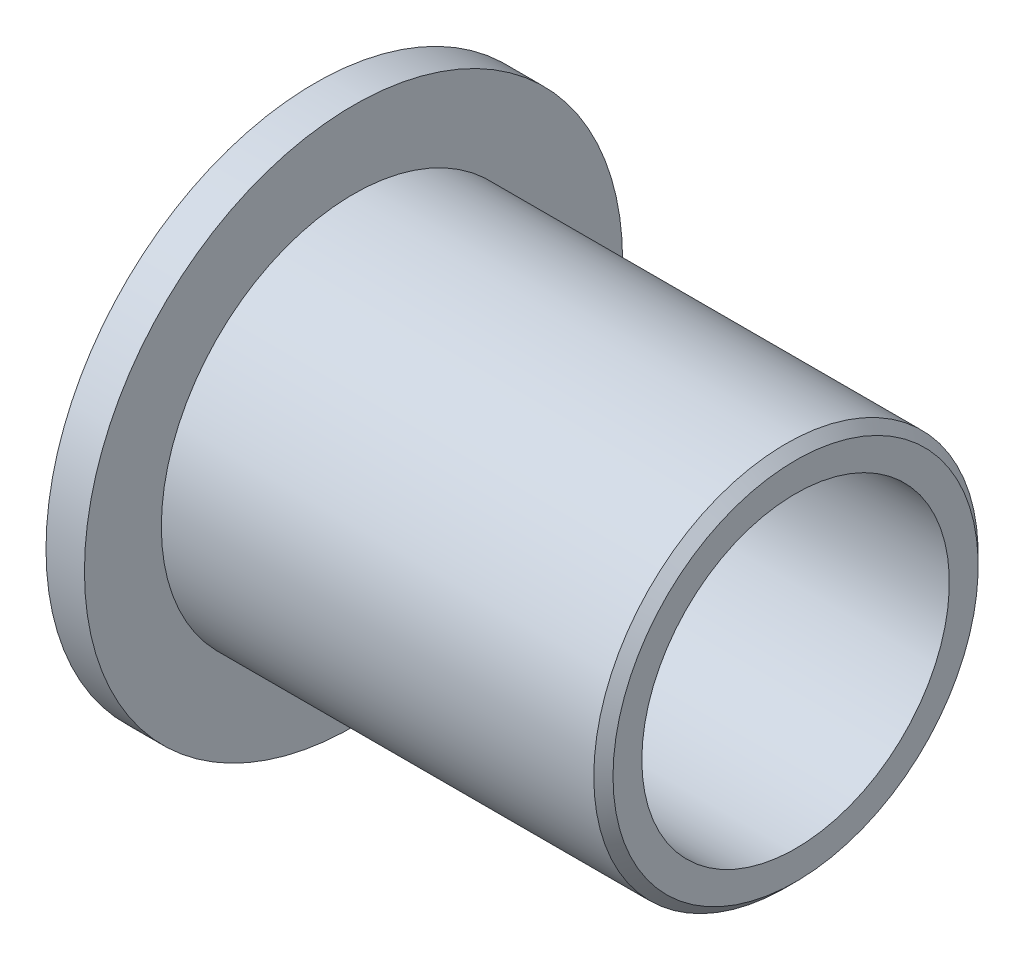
from build123d import *

# Parameters (mm, degrees)
CHANFREIN1_SIZE = 0.5


with BuildPart() as part:
    # Esquisse1 → R_volution1 (revolve)
    with BuildSketch(Plane.XY, mode=Mode.PRIVATE) as r_volution1_sk:
        Polygon((0, 14), (2, 14), (2, 10), (25, 10), (25, 8), (0, 8), align=None)
    revolve(r_volution1_sk.sketch.rotate(Axis((0, 0, 0), (1, 0, 0)), 90), axis=Axis((0, 0, 0), (1, 0, 0)))

    # Chanfrein1
    chanfrein1_edges = [part.edges().sort_by_distance(p)[0] for p in [
        (25, 0, -10),
    ]]
    chamfer(chanfrein1_edges, length=CHANFREIN1_SIZE)


solid = part.part
